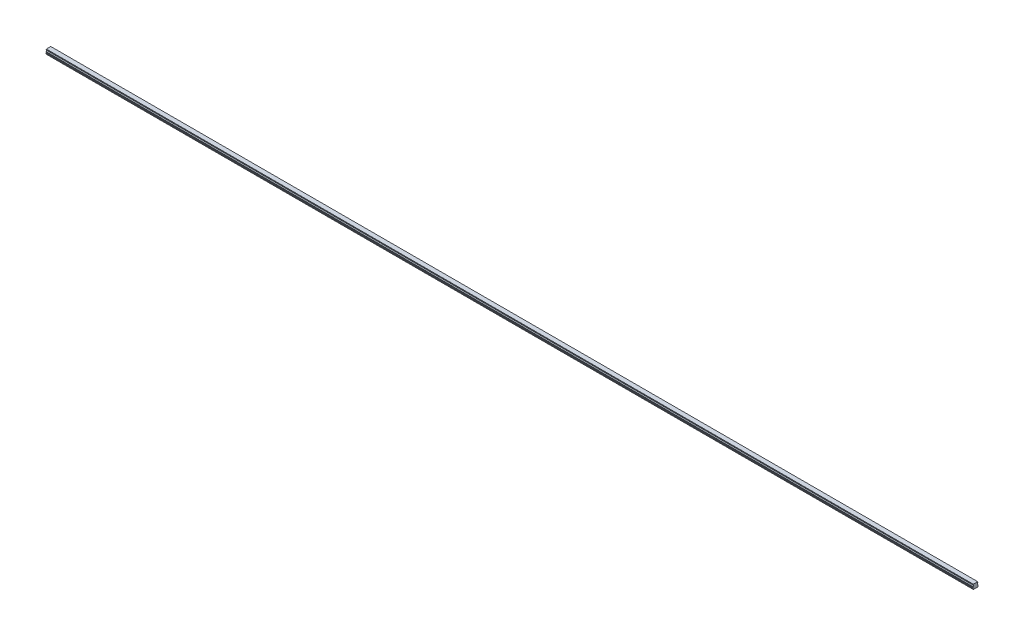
from build123d import *

# Parameters (mm, degrees)
BOSS_EXTRUDE1_DEPTH        = 2760
SKETCH3_R                  = 2.5
SKETCH3_R_2                = 2.1
CUT_EXTRUDE3_DEPTH         = 7
SKETCH3_2_R                = 2.1
CUT_EXTRUDE4_DEPTH         = 9.5
CHAMFER1_SIZE              = 0.4
LPATTERN2_COUNT            = 46
LPATTERN2_PITCH            = 60
CHAMFER1_OF_LPATTERN2_SIZE = 0.4


with BuildPart() as part:
    # Sketch1 → Boss-Extrude1 (new body)
    with BuildSketch(Plane(origin=(0, 0, 0), x_dir=(0, 0, -1), z_dir=(1, 0, 0))):
        with BuildLine():
            Line((6.59, 14), (-6.59, 14))
            Line((-6.59, 14), (-6.59, 13.15))
            Line((-6.59, 13.15), (-6.96, 12.356532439))
            Line((-6.96, 12.356532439), (-6.96, 11.435174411))
            ThreePointArc((-6.96, 11.435174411), (-5.25, 9.5), (-6.96, 7.564825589))
            Line((-6.96, 7.564825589), (-6.96, 6.643467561))
            Line((-6.96, 6.643467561), (-6.59, 5.85))
            Line((-6.59, 5.85), (-7.032116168, 4.2))
            Line((-7.032116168, 4.2), (-7.5, 3.929867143))
            Line((-7.5, 3.929867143), (-7.5, 1.4))
            Line((-7.5, 1.4), (-6.1, 0))
            Line((-6.1, 0), (-3.65, 0))
            Line((-3.65, 0), (-3.25, 0.4))
            Line((-3.25, 0.4), (3.25, 0.4))
            Line((3.25, 0.4), (3.65, 0))
            Line((3.65, 0), (6.1, 0))
            Line((6.1, 0), (7.5, 1.4))
            Line((7.5, 1.4), (7.5, 3.929867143))
            Line((7.5, 3.929867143), (7.032116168, 4.2))
            Line((7.032116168, 4.2), (6.59, 5.85))
            Line((6.59, 5.85), (6.96, 6.643467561))
            Line((6.96, 6.643467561), (6.96, 7.564825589))
            ThreePointArc((6.96, 7.564825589), (5.25, 9.5), (6.96, 11.435174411))
            Line((6.96, 11.435174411), (6.96, 12.356532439))
            Line((6.96, 12.356532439), (6.59, 13.15))
            Line((6.59, 13.15), (6.59, 14))
        make_face()
    extrude(amount=BOSS_EXTRUDE1_DEPTH)

    # Sketch3 → Cut-Extrude3 (cut)
    with BuildSketch(Plane.XZ):
        with Locations(Location((30, 0, 0), (0, 0, 270))):
            Circle(SKETCH3_R)
        with Locations(Location((30, 0, 0), (0, 0, 270))):
            Circle(SKETCH3_R_2, mode=Mode.SUBTRACT)
    cut_extrude3 = extrude(amount=-CUT_EXTRUDE3_DEPTH, mode=Mode.SUBTRACT)

    # Sketch3_2 → Cut-Extrude4 (cut)
    with BuildSketch(Plane.XZ):
        with Locations(Location((30, 0, 0), (0, 0, 270))):
            Circle(SKETCH3_2_R)
    cut_extrude4 = extrude(amount=-CUT_EXTRUDE4_DEPTH, mode=Mode.SUBTRACT)

    # Cut-Extrude5 cone 1 section (on through the dimple's axis) → Cut-Extrude5 (revolve, cut)
    with BuildSketch(Plane(origin=(30, 9.5, 0), x_dir=(0, 0, -1), z_dir=(1, 0, 0))):
        Polygon((0, 0), (2.1, 0), (0, 1.212435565), align=None)
    revolve(axis=Axis((30, 9.5, 0), (0, 1, 0)), mode=Mode.SUBTRACT)

    # Chamfer1
    chamfer1_edges = [part.edges().sort_by_distance(p)[0] for p in [
        (30, 0.4, 2.5),
    ]]
    chamfer(chamfer1_edges, length=CHAMFER1_SIZE)

    # LPattern2: Cut-Extrude3, Cut-Extrude4 ×46
    with Locations(*[(i * LPATTERN2_PITCH, 0, 0) for i in range(1, LPATTERN2_COUNT)]):
        add(cut_extrude3, mode=Mode.SUBTRACT)
        add(cut_extrude4, mode=Mode.SUBTRACT)

    # Chamfer1 of LPattern2
    chamfer1_of_lpattern2_edges = [part.edges().sort_by_distance(p)[0] for p in [
        (90, 0.4, 2.5),
        (150, 0.4, 2.5),
        (210, 0.4, 2.5),
        (270, 0.4, 2.5),
        (330, 0.4, 2.5),
        (390, 0.4, 2.5),
        (450, 0.4, 2.5),
        (510, 0.4, 2.5),
        (570, 0.4, 2.5),
        (630, 0.4, 2.5),
        (690, 0.4, 2.5),
        (750, 0.4, 2.5),
        (810, 0.4, 2.5),
        (870, 0.4, 2.5),
        (930, 0.4, 2.5),
        (990, 0.4, 2.5),
        (1050, 0.4, 2.5),
        (1110, 0.4, 2.5),
        (1170, 0.4, 2.5),
        (1230, 0.4, 2.5),
        (1290, 0.4, 2.5),
        (1350, 0.4, 2.5),
        (1410, 0.4, 2.5),
        (1470, 0.4, 2.5),
        (1530, 0.4, 2.5),
        (1590, 0.4, 2.5),
        (1650, 0.4, 2.5),
        (1710, 0.4, 2.5),
        (1770, 0.4, 2.5),
        (1830, 0.4, 2.5),
        (1890, 0.4, 2.5),
        (1950, 0.4, 2.5),
        (2010, 0.4, 2.5),
        (2070, 0.4, 2.5),
        (2130, 0.4, 2.5),
        (2190, 0.4, 2.5),
        (2250, 0.4, 2.5),
        (2310, 0.4, 2.5),
        (2370, 0.4, 2.5),
        (2430, 0.4, 2.5),
        (2490, 0.4, 2.5),
        (2550, 0.4, 2.5),
        (2610, 0.4, 2.5),
        (2670, 0.4, 2.5),
        (2730, 0.4, 2.5),
    ]]
    chamfer(chamfer1_of_lpattern2_edges, length=CHAMFER1_OF_LPATTERN2_SIZE)


solid = part.part
